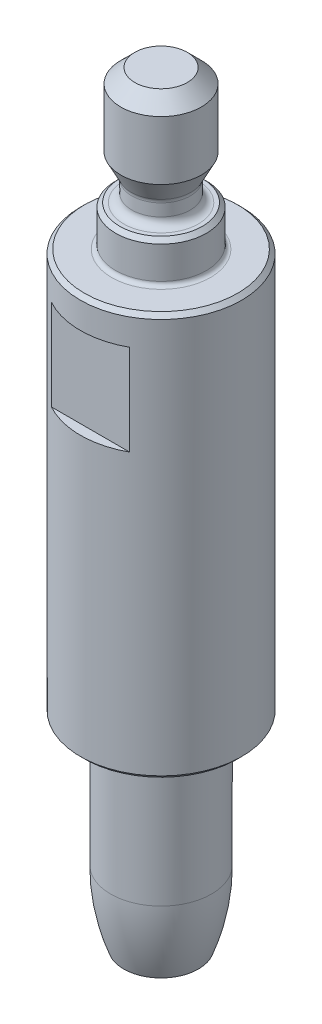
ISO-10303-21;
HEADER;
FILE_DESCRIPTION(('STEP AP214'),'2;1');
FILE_NAME('part.step','',(''),(''),'','','');
FILE_SCHEMA(('AUTOMOTIVE_DESIGN { 1 0 10303 214 1 1 1 1 }'));
ENDSEC;
DATA;
#1=APPLICATION_CONTEXT('core data for automotive mechanical design processes');
#2=APPLICATION_PROTOCOL_DEFINITION('international standard','automotive_design',2000,#1);
#3=PRODUCT_CONTEXT('',#1,'mechanical');
#4=PRODUCT('Part','Part','',(#3));
#5=PRODUCT_RELATED_PRODUCT_CATEGORY('part','',(#4));
#6=PRODUCT_DEFINITION_FORMATION('','',#4);
#7=PRODUCT_DEFINITION_CONTEXT('part definition',#1,'design');
#8=PRODUCT_DEFINITION('design','',#6,#7);
#9=PRODUCT_DEFINITION_SHAPE('','',#8);
#10=(LENGTH_UNIT() NAMED_UNIT(*) SI_UNIT(.MILLI.,.METRE.));
#11=(NAMED_UNIT(*) PLANE_ANGLE_UNIT() SI_UNIT($,.RADIAN.));
#12=(NAMED_UNIT(*) SI_UNIT($,.STERADIAN.) SOLID_ANGLE_UNIT());
#13=UNCERTAINTY_MEASURE_WITH_UNIT(LENGTH_MEASURE(1.E-05),#10,'distance_accuracy_value','');
#14=(GEOMETRIC_REPRESENTATION_CONTEXT(3) GLOBAL_UNCERTAINTY_ASSIGNED_CONTEXT((#13)) GLOBAL_UNIT_ASSIGNED_CONTEXT((#10,
#11,#12)) REPRESENTATION_CONTEXT('',''));
#15=CARTESIAN_POINT('',(0.,0.,0.));
#16=DIRECTION('',(0.,0.,1.));
#17=DIRECTION('',(1.,0.,0.));
#18=AXIS2_PLACEMENT_3D('',#15,#16,#17);
#19=CARTESIAN_POINT('',(0.,0.,0.));
#20=DIRECTION('',(0.,1.,0.));
#21=DIRECTION('',(-1.,0.,0.));
#22=AXIS2_PLACEMENT_3D('',#19,#20,#21);
#23=CYLINDRICAL_SURFACE('',#22,2.5);
#24=CARTESIAN_POINT('',(0.,-20.2,0.));
#25=DIRECTION('',(0.,-1.,0.));
#26=DIRECTION('',(0.,0.,-1.));
#27=AXIS2_PLACEMENT_3D('',#24,#25,#26);
#28=CIRCLE('',#27,2.5);
#29=CARTESIAN_POINT('',(0.,-20.2,-2.5));
#30=VERTEX_POINT('',#29);
#31=EDGE_CURVE('E64',#30,#30,#28,.T.);
#32=ORIENTED_EDGE('',*,*,#31,.T.);
#33=EDGE_LOOP('',(#32));
#34=FACE_BOUND('',#33,.T.);
#35=CARTESIAN_POINT('',(0.,-26.453522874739,0.));
#36=DIRECTION('',(0.,1.,0.));
#37=DIRECTION('',(0.,0.,1.));
#38=AXIS2_PLACEMENT_3D('',#35,#36,#37);
#39=CIRCLE('',#38,2.5);
#40=CARTESIAN_POINT('',(0.,-26.453522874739,2.5));
#41=VERTEX_POINT('',#40);
#42=EDGE_CURVE('E295',#41,#41,#39,.T.);
#43=ORIENTED_EDGE('',*,*,#42,.T.);
#44=EDGE_LOOP('',(#43));
#45=FACE_BOUND('',#44,.T.);
#46=ADVANCED_FACE('F15',(#34,#45),#23,.T.);
#47=CARTESIAN_POINT('',(0.,0.,0.));
#48=DIRECTION('',(0.,1.,0.));
#49=DIRECTION('',(0.,0.,1.));
#50=AXIS2_PLACEMENT_3D('',#47,#48,#49);
#51=PLANE('',#50);
#52=CARTESIAN_POINT('',(0.,0.,0.));
#53=DIRECTION('',(0.,1.,0.));
#54=DIRECTION('',(0.,0.,1.));
#55=AXIS2_PLACEMENT_3D('',#52,#53,#54);
#56=CIRCLE('',#55,2.45);
#57=CARTESIAN_POINT('',(0.,0.,2.45));
#58=VERTEX_POINT('',#57);
#59=EDGE_CURVE('E122',#58,#58,#56,.F.);
#60=ORIENTED_EDGE('',*,*,#59,.T.);
#61=EDGE_LOOP('',(#60));
#62=FACE_BOUND('',#61,.T.);
#63=CARTESIAN_POINT('',(0.,0.,0.));
#64=DIRECTION('',(0.,1.,0.));
#65=DIRECTION('',(0.,0.,1.));
#66=AXIS2_PLACEMENT_3D('',#63,#64,#65);
#67=CIRCLE('',#66,3.8);
#68=CARTESIAN_POINT('',(0.,0.,3.8));
#69=VERTEX_POINT('',#68);
#70=EDGE_CURVE('E107',#69,#69,#67,.T.);
#71=ORIENTED_EDGE('',*,*,#70,.T.);
#72=EDGE_LOOP('',(#71));
#73=FACE_BOUND('',#72,.T.);
#74=ADVANCED_FACE('F147',(#62,#73),#51,.T.);
#75=CARTESIAN_POINT('',(0.,0.,0.));
#76=DIRECTION('',(0.,-1.,0.));
#77=DIRECTION('',(0.,0.,-1.));
#78=AXIS2_PLACEMENT_3D('',#75,#76,#77);
#79=CYLINDRICAL_SURFACE('',#78,4.);
#80=DIRECTION('',(0.,-1.,0.));
#81=VECTOR('',#80,1.);
#82=CARTESIAN_POINT('',(-1.93649167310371,0.,3.5));
#83=LINE('',#82,#81);
#84=CARTESIAN_POINT('',(-1.93649167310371,-1.5,3.5));
#85=VERTEX_POINT('',#84);
#86=CARTESIAN_POINT('',(-1.93649167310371,-6.,3.5));
#87=VERTEX_POINT('',#86);
#88=EDGE_CURVE('E137',#85,#87,#83,.T.);
#89=ORIENTED_EDGE('',*,*,#88,.F.);
#90=CARTESIAN_POINT('',(0.,-1.5,0.));
#91=DIRECTION('',(0.,1.,0.));
#92=DIRECTION('',(0.,0.,1.));
#93=AXIS2_PLACEMENT_3D('',#90,#91,#92);
#94=CIRCLE('',#93,4.);
#95=CARTESIAN_POINT('',(1.93649167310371,-1.5,3.5));
#96=VERTEX_POINT('',#95);
#97=EDGE_CURVE('E9',#96,#85,#94,.F.);
#98=ORIENTED_EDGE('',*,*,#97,.F.);
#99=DIRECTION('',(0.,-1.,0.));
#100=VECTOR('',#99,1.);
#101=CARTESIAN_POINT('',(1.93649167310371,0.,3.5));
#102=LINE('',#101,#100);
#103=CARTESIAN_POINT('',(1.93649167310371,-6.,3.5));
#104=VERTEX_POINT('',#103);
#105=EDGE_CURVE('E23',#104,#96,#102,.F.);
#106=ORIENTED_EDGE('',*,*,#105,.F.);
#107=CARTESIAN_POINT('',(0.,-6.,0.));
#108=DIRECTION('',(0.,-1.,0.));
#109=DIRECTION('',(0.,0.,-1.));
#110=AXIS2_PLACEMENT_3D('',#107,#108,#109);
#111=CIRCLE('',#110,4.);
#112=EDGE_CURVE('E135',#87,#104,#111,.F.);
#113=ORIENTED_EDGE('',*,*,#112,.F.);
#114=EDGE_LOOP('',(#89,#98,#106,#113));
#115=FACE_BOUND('',#114,.T.);
#116=DIRECTION('',(0.,-1.,0.));
#117=VECTOR('',#116,1.);
#118=CARTESIAN_POINT('',(-1.93649167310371,0.,-3.5));
#119=LINE('',#118,#117);
#120=CARTESIAN_POINT('',(-1.93649167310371,-6.,-3.5));
#121=VERTEX_POINT('',#120);
#122=CARTESIAN_POINT('',(-1.93649167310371,-1.5,-3.5));
#123=VERTEX_POINT('',#122);
#124=EDGE_CURVE('E59',#121,#123,#119,.F.);
#125=ORIENTED_EDGE('',*,*,#124,.F.);
#126=CARTESIAN_POINT('',(0.,-6.,0.));
#127=DIRECTION('',(0.,-1.,0.));
#128=DIRECTION('',(0.,0.,-1.));
#129=AXIS2_PLACEMENT_3D('',#126,#127,#128);
#130=CIRCLE('',#129,4.);
#131=CARTESIAN_POINT('',(1.93649167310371,-6.,-3.5));
#132=VERTEX_POINT('',#131);
#133=EDGE_CURVE('E72',#132,#121,#130,.F.);
#134=ORIENTED_EDGE('',*,*,#133,.F.);
#135=DIRECTION('',(0.,-1.,0.));
#136=VECTOR('',#135,1.);
#137=CARTESIAN_POINT('',(1.93649167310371,0.,-3.5));
#138=LINE('',#137,#136);
#139=CARTESIAN_POINT('',(1.93649167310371,-1.5,-3.5));
#140=VERTEX_POINT('',#139);
#141=EDGE_CURVE('E60',#140,#132,#138,.T.);
#142=ORIENTED_EDGE('',*,*,#141,.F.);
#143=CARTESIAN_POINT('',(0.,-1.5,0.));
#144=DIRECTION('',(0.,1.,0.));
#145=DIRECTION('',(0.,0.,1.));
#146=AXIS2_PLACEMENT_3D('',#143,#144,#145);
#147=CIRCLE('',#146,4.);
#148=EDGE_CURVE('E54',#123,#140,#147,.F.);
#149=ORIENTED_EDGE('',*,*,#148,.F.);
#150=EDGE_LOOP('',(#125,#134,#142,#149));
#151=FACE_BOUND('',#150,.T.);
#152=CARTESIAN_POINT('',(0.,-19.8,0.));
#153=DIRECTION('',(0.,-1.,0.));
#154=DIRECTION('',(0.,0.,-1.));
#155=AXIS2_PLACEMENT_3D('',#152,#153,#154);
#156=CIRCLE('',#155,4.);
#157=CARTESIAN_POINT('',(0.,-19.8,-4.));
#158=VERTEX_POINT('',#157);
#159=EDGE_CURVE('E119',#158,#158,#156,.F.);
#160=ORIENTED_EDGE('',*,*,#159,.T.);
#161=EDGE_LOOP('',(#160));
#162=FACE_BOUND('',#161,.T.);
#163=CARTESIAN_POINT('',(0.,-0.2,0.));
#164=DIRECTION('',(0.,1.,0.));
#165=DIRECTION('',(0.,0.,1.));
#166=AXIS2_PLACEMENT_3D('',#163,#164,#165);
#167=CIRCLE('',#166,4.);
#168=CARTESIAN_POINT('',(0.,-0.2,4.));
#169=VERTEX_POINT('',#168);
#170=EDGE_CURVE('E104',#169,#169,#167,.F.);
#171=ORIENTED_EDGE('',*,*,#170,.T.);
#172=EDGE_LOOP('',(#171));
#173=FACE_BOUND('',#172,.T.);
#174=ADVANCED_FACE('F56',(#115,#151,#162,#173),#79,.T.);
#175=CARTESIAN_POINT('',(4.,-20.,0.));
#176=DIRECTION('',(0.,-1.,0.));
#177=DIRECTION('',(0.,0.,-1.));
#178=AXIS2_PLACEMENT_3D('',#175,#176,#177);
#179=PLANE('',#178);
#180=CARTESIAN_POINT('',(0.,-20.,0.));
#181=DIRECTION('',(0.,-1.,0.));
#182=DIRECTION('',(0.,0.,-1.));
#183=AXIS2_PLACEMENT_3D('',#180,#181,#182);
#184=CIRCLE('',#183,2.7);
#185=CARTESIAN_POINT('',(0.,-20.,-2.7));
#186=VERTEX_POINT('',#185);
#187=EDGE_CURVE('E128',#186,#186,#184,.F.);
#188=ORIENTED_EDGE('',*,*,#187,.T.);
#189=EDGE_LOOP('',(#188));
#190=FACE_BOUND('',#189,.T.);
#191=CARTESIAN_POINT('',(0.,-20.,0.));
#192=DIRECTION('',(0.,-1.,0.));
#193=DIRECTION('',(0.,0.,-1.));
#194=AXIS2_PLACEMENT_3D('',#191,#192,#193);
#195=CIRCLE('',#194,3.8);
#196=CARTESIAN_POINT('',(0.,-20.,-3.8));
#197=VERTEX_POINT('',#196);
#198=EDGE_CURVE('E116',#197,#197,#195,.T.);
#199=ORIENTED_EDGE('',*,*,#198,.T.);
#200=EDGE_LOOP('',(#199));
#201=FACE_BOUND('',#200,.T.);
#202=ADVANCED_FACE('F146',(#190,#201),#179,.T.);
#203=CARTESIAN_POINT('',(0.,2.,0.));
#204=DIRECTION('',(0.,1.,0.));
#205=DIRECTION('',(0.,0.,1.));
#206=AXIS2_PLACEMENT_3D('',#203,#204,#205);
#207=PLANE('',#206);
#208=CARTESIAN_POINT('',(0.,2.,0.));
#209=DIRECTION('',(0.,1.,0.));
#210=DIRECTION('',(0.,0.,1.));
#211=AXIS2_PLACEMENT_3D('',#208,#209,#210);
#212=CIRCLE('',#211,2.05);
#213=CARTESIAN_POINT('',(0.,2.,2.05));
#214=VERTEX_POINT('',#213);
#215=EDGE_CURVE('E113',#214,#214,#212,.T.);
#216=ORIENTED_EDGE('',*,*,#215,.T.);
#217=EDGE_LOOP('',(#216));
#218=FACE_BOUND('',#217,.T.);
#219=CARTESIAN_POINT('',(0.,2.,0.));
#220=DIRECTION('',(0.,1.,0.));
#221=DIRECTION('',(0.,0.,1.));
#222=AXIS2_PLACEMENT_3D('',#219,#220,#221);
#223=CIRCLE('',#222,1.85);
#224=CARTESIAN_POINT('',(0.,2.,1.85));
#225=VERTEX_POINT('',#224);
#226=EDGE_CURVE('E101',#225,#225,#223,.F.);
#227=ORIENTED_EDGE('',*,*,#226,.T.);
#228=EDGE_LOOP('',(#227));
#229=FACE_BOUND('',#228,.T.);
#230=ADVANCED_FACE('F155',(#218,#229),#207,.T.);
#231=CARTESIAN_POINT('',(0.,0.,0.));
#232=DIRECTION('',(0.,-1.,0.));
#233=DIRECTION('',(0.,0.,-1.));
#234=AXIS2_PLACEMENT_3D('',#231,#232,#233);
#235=CYLINDRICAL_SURFACE('',#234,2.25);
#236=CARTESIAN_POINT('',(0.,0.2,0.));
#237=DIRECTION('',(0.,1.,0.));
#238=DIRECTION('',(0.,0.,1.));
#239=AXIS2_PLACEMENT_3D('',#236,#237,#238);
#240=CIRCLE('',#239,2.25);
#241=CARTESIAN_POINT('',(0.,0.2,2.25));
#242=VERTEX_POINT('',#241);
#243=EDGE_CURVE('E125',#242,#242,#240,.T.);
#244=ORIENTED_EDGE('',*,*,#243,.T.);
#245=EDGE_LOOP('',(#244));
#246=FACE_BOUND('',#245,.T.);
#247=CARTESIAN_POINT('',(0.,1.8,0.));
#248=DIRECTION('',(0.,1.,0.));
#249=DIRECTION('',(0.,0.,1.));
#250=AXIS2_PLACEMENT_3D('',#247,#248,#249);
#251=CIRCLE('',#250,2.25);
#252=CARTESIAN_POINT('',(0.,1.8,2.25));
#253=VERTEX_POINT('',#252);
#254=EDGE_CURVE('E110',#253,#253,#251,.F.);
#255=ORIENTED_EDGE('',*,*,#254,.T.);
#256=EDGE_LOOP('',(#255));
#257=FACE_BOUND('',#256,.T.);
#258=ADVANCED_FACE('F179',(#246,#257),#235,.T.);
#259=CARTESIAN_POINT('',(0.,4.17943577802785,0.));
#260=DIRECTION('',(0.,1.,0.));
#261=DIRECTION('',(0.,0.,1.));
#262=AXIS2_PLACEMENT_3D('',#259,#260,#261);
#263=CONICAL_SURFACE('',#262,2.,0.471238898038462);
#264=CARTESIAN_POINT('',(0.,3.18556469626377,0.));
#265=DIRECTION('',(0.,1.,0.));
#266=DIRECTION('',(0.,0.,1.));
#267=AXIS2_PLACEMENT_3D('',#264,#265,#266);
#268=CIRCLE('',#267,1.49359739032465);
#269=CARTESIAN_POINT('',(0.,3.18556469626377,1.49359739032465));
#270=VERTEX_POINT('',#269);
#271=EDGE_CURVE('E98',#270,#270,#268,.T.);
#272=ORIENTED_EDGE('',*,*,#271,.T.);
#273=EDGE_LOOP('',(#272));
#274=FACE_BOUND('',#273,.T.);
#275=CARTESIAN_POINT('',(0.,4.17943577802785,0.));
#276=DIRECTION('',(0.,-1.,0.));
#277=DIRECTION('',(0.,0.,-1.));
#278=AXIS2_PLACEMENT_3D('',#275,#276,#277);
#279=CIRCLE('',#278,2.);
#280=CARTESIAN_POINT('',(0.,4.17943577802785,-2.));
#281=VERTEX_POINT('',#280);
#282=EDGE_CURVE('E83',#281,#281,#279,.T.);
#283=ORIENTED_EDGE('',*,*,#282,.T.);
#284=EDGE_LOOP('',(#283));
#285=FACE_BOUND('',#284,.T.);
#286=ADVANCED_FACE('F175',(#274,#285),#263,.T.);
#287=CARTESIAN_POINT('',(0.,0.,0.));
#288=DIRECTION('',(0.,-1.,0.));
#289=DIRECTION('',(0.,0.,-1.));
#290=AXIS2_PLACEMENT_3D('',#287,#288,#289);
#291=CYLINDRICAL_SURFACE('',#290,1.45);
#292=CARTESIAN_POINT('',(0.,3.00396849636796,0.));
#293=DIRECTION('',(0.,-1.,0.));
#294=DIRECTION('',(0.,0.,-1.));
#295=AXIS2_PLACEMENT_3D('',#292,#293,#294);
#296=CIRCLE('',#295,1.45);
#297=CARTESIAN_POINT('',(0.,3.00396849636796,-1.45));
#298=VERTEX_POINT('',#297);
#299=EDGE_CURVE('E95',#298,#298,#296,.T.);
#300=ORIENTED_EDGE('',*,*,#299,.T.);
#301=EDGE_LOOP('',(#300));
#302=FACE_BOUND('',#301,.T.);
#303=CARTESIAN_POINT('',(0.,2.4,0.));
#304=DIRECTION('',(0.,1.,0.));
#305=DIRECTION('',(0.,0.,1.));
#306=AXIS2_PLACEMENT_3D('',#303,#304,#305);
#307=CIRCLE('',#306,1.45);
#308=CARTESIAN_POINT('',(0.,2.4,1.45));
#309=VERTEX_POINT('',#308);
#310=EDGE_CURVE('E92',#309,#309,#307,.T.);
#311=ORIENTED_EDGE('',*,*,#310,.T.);
#312=EDGE_LOOP('',(#311));
#313=FACE_BOUND('',#312,.T.);
#314=ADVANCED_FACE('F171',(#302,#313),#291,.T.);
#315=CARTESIAN_POINT('',(0.,7.8,0.));
#316=DIRECTION('',(0.,1.,0.));
#317=DIRECTION('',(0.,0.,1.));
#318=AXIS2_PLACEMENT_3D('',#315,#316,#317);
#319=PLANE('',#318);
#320=CARTESIAN_POINT('',(0.,7.8,0.));
#321=DIRECTION('',(0.,1.,0.));
#322=DIRECTION('',(0.,0.,1.));
#323=AXIS2_PLACEMENT_3D('',#320,#321,#322);
#324=CIRCLE('',#323,1.3);
#325=CARTESIAN_POINT('',(0.,7.8,1.3));
#326=VERTEX_POINT('',#325);
#327=EDGE_CURVE('E89',#326,#326,#324,.T.);
#328=ORIENTED_EDGE('',*,*,#327,.T.);
#329=EDGE_LOOP('',(#328));
#330=FACE_BOUND('',#329,.T.);
#331=ADVANCED_FACE('F174',(#330),#319,.T.);
#332=CARTESIAN_POINT('',(0.,7.1,0.));
#333=DIRECTION('',(0.,-1.,0.));
#334=DIRECTION('',(0.,0.,-1.));
#335=AXIS2_PLACEMENT_3D('',#332,#333,#334);
#336=CONICAL_SURFACE('',#335,2.,0.78539816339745);
#337=ORIENTED_EDGE('',*,*,#327,.F.);
#338=EDGE_LOOP('',(#337));
#339=FACE_BOUND('',#338,.T.);
#340=CARTESIAN_POINT('',(0.,7.1,0.));
#341=DIRECTION('',(0.,1.,0.));
#342=DIRECTION('',(0.,0.,1.));
#343=AXIS2_PLACEMENT_3D('',#340,#341,#342);
#344=CIRCLE('',#343,2.);
#345=CARTESIAN_POINT('',(0.,7.1,2.));
#346=VERTEX_POINT('',#345);
#347=EDGE_CURVE('E86',#346,#346,#344,.F.);
#348=ORIENTED_EDGE('',*,*,#347,.F.);
#349=EDGE_LOOP('',(#348));
#350=FACE_BOUND('',#349,.T.);
#351=ADVANCED_FACE('F185',(#339,#350),#336,.T.);
#352=CARTESIAN_POINT('',(0.,2.,0.));
#353=DIRECTION('',(0.,-1.,0.));
#354=DIRECTION('',(0.,0.,-1.));
#355=AXIS2_PLACEMENT_3D('',#352,#353,#354);
#356=CYLINDRICAL_SURFACE('',#355,2.);
#357=ORIENTED_EDGE('',*,*,#282,.F.);
#358=EDGE_LOOP('',(#357));
#359=FACE_BOUND('',#358,.T.);
#360=ORIENTED_EDGE('',*,*,#347,.T.);
#361=EDGE_LOOP('',(#360));
#362=FACE_BOUND('',#361,.T.);
#363=ADVANCED_FACE('F181',(#359,#362),#356,.T.);
#364=CARTESIAN_POINT('',(0.,3.00396849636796,0.));
#365=DIRECTION('',(0.,-1.,0.));
#366=DIRECTION('',(0.,0.,-1.));
#367=AXIS2_PLACEMENT_3D('',#364,#365,#366);
#368=TOROIDAL_SURFACE('',#367,1.85,0.4);
#369=ORIENTED_EDGE('',*,*,#271,.F.);
#370=EDGE_LOOP('',(#369));
#371=FACE_BOUND('',#370,.T.);
#372=ORIENTED_EDGE('',*,*,#299,.F.);
#373=EDGE_LOOP('',(#372));
#374=FACE_BOUND('',#373,.T.);
#375=ADVANCED_FACE('F184',(#371,#374),#368,.F.);
#376=CARTESIAN_POINT('',(0.,2.4,0.));
#377=DIRECTION('',(0.,1.,0.));
#378=DIRECTION('',(0.,0.,1.));
#379=AXIS2_PLACEMENT_3D('',#376,#377,#378);
#380=TOROIDAL_SURFACE('',#379,1.85,0.4);
#381=ORIENTED_EDGE('',*,*,#310,.F.);
#382=EDGE_LOOP('',(#381));
#383=FACE_BOUND('',#382,.T.);
#384=ORIENTED_EDGE('',*,*,#226,.F.);
#385=EDGE_LOOP('',(#384));
#386=FACE_BOUND('',#385,.T.);
#387=ADVANCED_FACE('F202',(#383,#386),#380,.F.);
#388=CARTESIAN_POINT('',(0.,-0.2,0.));
#389=DIRECTION('',(0.,-1.,0.));
#390=DIRECTION('',(0.,0.,-1.));
#391=AXIS2_PLACEMENT_3D('',#388,#389,#390);
#392=CONICAL_SURFACE('',#391,4.,0.785398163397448);
#393=ORIENTED_EDGE('',*,*,#70,.F.);
#394=EDGE_LOOP('',(#393));
#395=FACE_BOUND('',#394,.T.);
#396=ORIENTED_EDGE('',*,*,#170,.F.);
#397=EDGE_LOOP('',(#396));
#398=FACE_BOUND('',#397,.T.);
#399=ADVANCED_FACE('F204',(#395,#398),#392,.T.);
#400=CARTESIAN_POINT('',(0.,1.8,0.));
#401=DIRECTION('',(0.,-1.,0.));
#402=DIRECTION('',(0.,0.,-1.));
#403=AXIS2_PLACEMENT_3D('',#400,#401,#402);
#404=CONICAL_SURFACE('',#403,2.25,0.785398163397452);
#405=ORIENTED_EDGE('',*,*,#215,.F.);
#406=EDGE_LOOP('',(#405));
#407=FACE_BOUND('',#406,.T.);
#408=ORIENTED_EDGE('',*,*,#254,.F.);
#409=EDGE_LOOP('',(#408));
#410=FACE_BOUND('',#409,.T.);
#411=ADVANCED_FACE('F212',(#407,#410),#404,.T.);
#412=CARTESIAN_POINT('',(0.,-20.,0.));
#413=DIRECTION('',(0.,1.,0.));
#414=DIRECTION('',(0.,0.,1.));
#415=AXIS2_PLACEMENT_3D('',#412,#413,#414);
#416=CONICAL_SURFACE('',#415,3.8,0.785398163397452);
#417=ORIENTED_EDGE('',*,*,#159,.F.);
#418=EDGE_LOOP('',(#417));
#419=FACE_BOUND('',#418,.T.);
#420=ORIENTED_EDGE('',*,*,#198,.F.);
#421=EDGE_LOOP('',(#420));
#422=FACE_BOUND('',#421,.T.);
#423=ADVANCED_FACE('F230',(#419,#422),#416,.T.);
#424=CARTESIAN_POINT('',(0.,0.2,0.));
#425=DIRECTION('',(0.,1.,0.));
#426=DIRECTION('',(0.,0.,1.));
#427=AXIS2_PLACEMENT_3D('',#424,#425,#426);
#428=TOROIDAL_SURFACE('',#427,2.45,0.2);
#429=ORIENTED_EDGE('',*,*,#243,.F.);
#430=EDGE_LOOP('',(#429));
#431=FACE_BOUND('',#430,.T.);
#432=ORIENTED_EDGE('',*,*,#59,.F.);
#433=EDGE_LOOP('',(#432));
#434=FACE_BOUND('',#433,.T.);
#435=ADVANCED_FACE('F235',(#431,#434),#428,.F.);
#436=CARTESIAN_POINT('',(0.,-20.2,0.));
#437=DIRECTION('',(0.,-1.,0.));
#438=DIRECTION('',(0.,0.,-1.));
#439=AXIS2_PLACEMENT_3D('',#436,#437,#438);
#440=TOROIDAL_SURFACE('',#439,2.7,0.2);
#441=ORIENTED_EDGE('',*,*,#31,.F.);
#442=EDGE_LOOP('',(#441));
#443=FACE_BOUND('',#442,.T.);
#444=ORIENTED_EDGE('',*,*,#187,.F.);
#445=EDGE_LOOP('',(#444));
#446=FACE_BOUND('',#445,.T.);
#447=ADVANCED_FACE('F17',(#443,#446),#440,.F.);
#448=CARTESIAN_POINT('',(-4.,-6.,-4.));
#449=DIRECTION('',(0.,-1.,0.));
#450=DIRECTION('',(0.,0.,-1.));
#451=AXIS2_PLACEMENT_3D('',#448,#449,#450);
#452=PLANE('',#451);
#453=ORIENTED_EDGE('',*,*,#133,.T.);
#454=DIRECTION('',(1.,0.,0.));
#455=VECTOR('',#454,1.);
#456=CARTESIAN_POINT('',(-4.,-6.,-3.5));
#457=LINE('',#456,#455);
#458=EDGE_CURVE('E71',#121,#132,#457,.T.);
#459=ORIENTED_EDGE('',*,*,#458,.T.);
#460=EDGE_LOOP('',(#453,#459));
#461=FACE_BOUND('',#460,.T.);
#462=ADVANCED_FACE('F243',(#461),#452,.F.);
#463=CARTESIAN_POINT('',(-4.,-1.5,-3.5));
#464=DIRECTION('',(0.,0.,1.));
#465=DIRECTION('',(0.,-1.,0.));
#466=AXIS2_PLACEMENT_3D('',#463,#464,#465);
#467=PLANE('',#466);
#468=ORIENTED_EDGE('',*,*,#124,.T.);
#469=DIRECTION('',(1.,0.,0.));
#470=VECTOR('',#469,1.);
#471=CARTESIAN_POINT('',(-4.,-1.5,-3.5));
#472=LINE('',#471,#470);
#473=EDGE_CURVE('E69',#123,#140,#472,.T.);
#474=ORIENTED_EDGE('',*,*,#473,.T.);
#475=ORIENTED_EDGE('',*,*,#141,.T.);
#476=ORIENTED_EDGE('',*,*,#458,.F.);
#477=EDGE_LOOP('',(#468,#474,#475,#476));
#478=FACE_BOUND('',#477,.T.);
#479=ADVANCED_FACE('F68',(#478),#467,.F.);
#480=CARTESIAN_POINT('',(-4.,-1.5,-4.));
#481=DIRECTION('',(0.,1.,0.));
#482=DIRECTION('',(0.,0.,1.));
#483=AXIS2_PLACEMENT_3D('',#480,#481,#482);
#484=PLANE('',#483);
#485=ORIENTED_EDGE('',*,*,#473,.F.);
#486=ORIENTED_EDGE('',*,*,#148,.T.);
#487=EDGE_LOOP('',(#485,#486));
#488=FACE_BOUND('',#487,.T.);
#489=ADVANCED_FACE('F74',(#488),#484,.F.);
#490=CARTESIAN_POINT('',(-4.,-1.5,4.));
#491=DIRECTION('',(0.,1.,0.));
#492=DIRECTION('',(0.,0.,1.));
#493=AXIS2_PLACEMENT_3D('',#490,#491,#492);
#494=PLANE('',#493);
#495=ORIENTED_EDGE('',*,*,#97,.T.);
#496=DIRECTION('',(1.,0.,0.));
#497=VECTOR('',#496,1.);
#498=CARTESIAN_POINT('',(-4.,-1.5,3.5));
#499=LINE('',#498,#497);
#500=EDGE_CURVE('E77',#85,#96,#499,.T.);
#501=ORIENTED_EDGE('',*,*,#500,.T.);
#502=EDGE_LOOP('',(#495,#501));
#503=FACE_BOUND('',#502,.T.);
#504=ADVANCED_FACE('F275',(#503),#494,.F.);
#505=CARTESIAN_POINT('',(-4.,-1.5,3.5));
#506=DIRECTION('',(0.,0.,-1.));
#507=DIRECTION('',(0.,1.,0.));
#508=AXIS2_PLACEMENT_3D('',#505,#506,#507);
#509=PLANE('',#508);
#510=ORIENTED_EDGE('',*,*,#105,.T.);
#511=ORIENTED_EDGE('',*,*,#500,.F.);
#512=ORIENTED_EDGE('',*,*,#88,.T.);
#513=DIRECTION('',(1.,0.,0.));
#514=VECTOR('',#513,1.);
#515=CARTESIAN_POINT('',(-4.,-6.,3.5));
#516=LINE('',#515,#514);
#517=EDGE_CURVE('E75',#87,#104,#516,.T.);
#518=ORIENTED_EDGE('',*,*,#517,.T.);
#519=EDGE_LOOP('',(#510,#511,#512,#518));
#520=FACE_BOUND('',#519,.T.);
#521=ADVANCED_FACE('F141',(#520),#509,.F.);
#522=CARTESIAN_POINT('',(-4.,-6.,4.));
#523=DIRECTION('',(0.,-1.,0.));
#524=DIRECTION('',(0.,0.,-1.));
#525=AXIS2_PLACEMENT_3D('',#522,#523,#524);
#526=PLANE('',#525);
#527=ORIENTED_EDGE('',*,*,#517,.F.);
#528=ORIENTED_EDGE('',*,*,#112,.T.);
#529=EDGE_LOOP('',(#527,#528));
#530=FACE_BOUND('',#529,.T.);
#531=ADVANCED_FACE('F144',(#530),#526,.F.);
#532=CARTESIAN_POINT('',(0.,-26.453522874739,0.));
#533=DIRECTION('',(0.,1.,0.));
#534=DIRECTION('',(0.,0.,1.));
#535=AXIS2_PLACEMENT_3D('',#532,#533,#534);
#536=DEGENERATE_TOROIDAL_SURFACE('',#535,7.5,10.,.F.);
#537=CARTESIAN_POINT('',(0.,-30.,0.));
#538=DIRECTION('',(0.,1.,0.));
#539=DIRECTION('',(0.,0.,1.));
#540=AXIS2_PLACEMENT_3D('',#537,#538,#539);
#541=CIRCLE('',#540,1.85);
#542=CARTESIAN_POINT('',(0.,-30.,1.85));
#543=VERTEX_POINT('',#542);
#544=EDGE_CURVE('E79',#543,#543,#541,.T.);
#545=ORIENTED_EDGE('',*,*,#544,.T.);
#546=EDGE_LOOP('',(#545));
#547=FACE_BOUND('',#546,.T.);
#548=ORIENTED_EDGE('',*,*,#42,.F.);
#549=EDGE_LOOP('',(#548));
#550=FACE_BOUND('',#549,.T.);
#551=ADVANCED_FACE('F278',(#547,#550),#536,.F.);
#552=CARTESIAN_POINT('',(2.23205080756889,-30.,0.));
#553=DIRECTION('',(0.,1.,0.));
#554=DIRECTION('',(-1.,0.,0.));
#555=AXIS2_PLACEMENT_3D('',#552,#553,#554);
#556=PLANE('',#555);
#557=ORIENTED_EDGE('',*,*,#544,.F.);
#558=EDGE_LOOP('',(#557));
#559=FACE_BOUND('',#558,.T.);
#560=ADVANCED_FACE('F169',(#559),#556,.F.);
#561=CLOSED_SHELL('',(#46,#74,#174,#202,#230,#258,#286,#314,#331,#351,#363,#375,#387,#399,#411,
#423,#435,#447,#462,#479,#489,#504,#521,#531,#551,#560));
#562=MANIFOLD_SOLID_BREP('B1',#561);
#563=ADVANCED_BREP_SHAPE_REPRESENTATION('',(#18,#562),#14);
#564=SHAPE_DEFINITION_REPRESENTATION(#9,#563);
ENDSEC;
END-ISO-10303-21;
